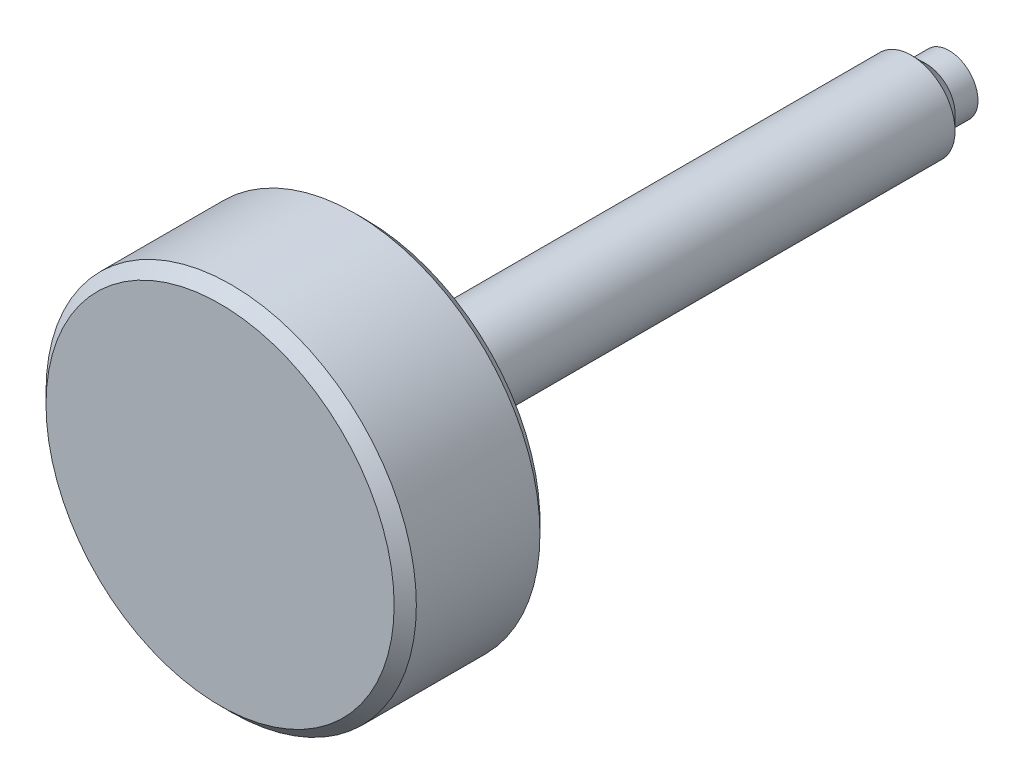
ISO-10303-21;
HEADER;
FILE_DESCRIPTION(('STEP AP214'),'2;1');
FILE_NAME('part.step','',(''),(''),'','','');
FILE_SCHEMA(('AUTOMOTIVE_DESIGN { 1 0 10303 214 1 1 1 1 }'));
ENDSEC;
DATA;
#1=APPLICATION_CONTEXT('core data for automotive mechanical design processes');
#2=APPLICATION_PROTOCOL_DEFINITION('international standard','automotive_design',2000,#1);
#3=PRODUCT_CONTEXT('',#1,'mechanical');
#4=PRODUCT('Part','Part','',(#3));
#5=PRODUCT_RELATED_PRODUCT_CATEGORY('part','',(#4));
#6=PRODUCT_DEFINITION_FORMATION('','',#4);
#7=PRODUCT_DEFINITION_CONTEXT('part definition',#1,'design');
#8=PRODUCT_DEFINITION('design','',#6,#7);
#9=PRODUCT_DEFINITION_SHAPE('','',#8);
#10=(LENGTH_UNIT() NAMED_UNIT(*) SI_UNIT(.MILLI.,.METRE.));
#11=(NAMED_UNIT(*) PLANE_ANGLE_UNIT() SI_UNIT($,.RADIAN.));
#12=(NAMED_UNIT(*) SI_UNIT($,.STERADIAN.) SOLID_ANGLE_UNIT());
#13=UNCERTAINTY_MEASURE_WITH_UNIT(LENGTH_MEASURE(1.E-05),#10,'distance_accuracy_value','');
#14=(GEOMETRIC_REPRESENTATION_CONTEXT(3) GLOBAL_UNCERTAINTY_ASSIGNED_CONTEXT((#13)) GLOBAL_UNIT_ASSIGNED_CONTEXT((#10,
#11,#12)) REPRESENTATION_CONTEXT('',''));
#15=CARTESIAN_POINT('',(0.,0.,0.));
#16=DIRECTION('',(0.,0.,1.));
#17=DIRECTION('',(1.,0.,0.));
#18=AXIS2_PLACEMENT_3D('',#15,#16,#17);
#19=CARTESIAN_POINT('',(12.081256,-12.081256,0.));
#20=DIRECTION('',(0.,0.,1.));
#21=DIRECTION('',(1.,0.,0.));
#22=AXIS2_PLACEMENT_3D('',#19,#20,#21);
#23=PLANE('',#22);
#24=CARTESIAN_POINT('',(0.,0.,0.));
#25=DIRECTION('',(0.,0.,1.));
#26=DIRECTION('',(1.,0.,0.));
#27=AXIS2_PLACEMENT_3D('',#24,#25,#26);
#28=CIRCLE('',#27,3.);
#29=CARTESIAN_POINT('',(3.,0.,0.));
#30=VERTEX_POINT('',#29);
#31=EDGE_CURVE('E43',#30,#30,#28,.T.);
#32=ORIENTED_EDGE('',*,*,#31,.T.);
#33=EDGE_LOOP('',(#32));
#34=FACE_BOUND('',#33,.T.);
#35=CARTESIAN_POINT('',(0.,0.,0.));
#36=DIRECTION('',(0.,0.,1.));
#37=DIRECTION('',(0.,1.,0.));
#38=AXIS2_PLACEMENT_3D('',#35,#36,#37);
#39=CIRCLE('',#38,11.938);
#40=CARTESIAN_POINT('',(0.,11.938,0.));
#41=VERTEX_POINT('',#40);
#42=EDGE_CURVE('E35',#41,#41,#39,.T.);
#43=ORIENTED_EDGE('',*,*,#42,.F.);
#44=EDGE_LOOP('',(#43));
#45=FACE_BOUND('',#44,.T.);
#46=ADVANCED_FACE('F12',(#34,#45),#23,.F.);
#47=CARTESIAN_POINT('',(0.,0.,0.762));
#48=DIRECTION('',(0.,0.,1.));
#49=DIRECTION('',(0.,1.,0.));
#50=AXIS2_PLACEMENT_3D('',#47,#48,#49);
#51=CONICAL_SURFACE('',#50,12.7,0.785398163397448);
#52=ORIENTED_EDGE('',*,*,#42,.T.);
#53=EDGE_LOOP('',(#52));
#54=FACE_BOUND('',#53,.T.);
#55=CARTESIAN_POINT('',(0.,0.,0.762));
#56=DIRECTION('',(0.,0.,-1.));
#57=DIRECTION('',(-1.,0.,0.));
#58=AXIS2_PLACEMENT_3D('',#55,#56,#57);
#59=CIRCLE('',#58,12.7);
#60=CARTESIAN_POINT('',(-12.7,0.,0.762));
#61=VERTEX_POINT('',#60);
#62=EDGE_CURVE('E25',#61,#61,#59,.F.);
#63=ORIENTED_EDGE('',*,*,#62,.F.);
#64=EDGE_LOOP('',(#63));
#65=FACE_BOUND('',#64,.T.);
#66=ADVANCED_FACE('F81',(#54,#65),#51,.T.);
#67=CARTESIAN_POINT('',(12.081256,12.081256,9.99998));
#68=DIRECTION('',(0.,0.,-1.));
#69=DIRECTION('',(-1.,0.,0.));
#70=AXIS2_PLACEMENT_3D('',#67,#68,#69);
#71=PLANE('',#70);
#72=CARTESIAN_POINT('',(0.,0.,9.99998));
#73=DIRECTION('',(0.,0.,-1.));
#74=DIRECTION('',(-1.,0.,0.));
#75=AXIS2_PLACEMENT_3D('',#72,#73,#74);
#76=CIRCLE('',#75,11.938);
#77=CARTESIAN_POINT('',(-11.938,0.,9.99998));
#78=VERTEX_POINT('',#77);
#79=EDGE_CURVE('E20',#78,#78,#76,.T.);
#80=ORIENTED_EDGE('',*,*,#79,.F.);
#81=EDGE_LOOP('',(#80));
#82=FACE_BOUND('',#81,.T.);
#83=ADVANCED_FACE('F76',(#82),#71,.F.);
#84=CARTESIAN_POINT('',(0.,0.,0.762));
#85=DIRECTION('',(0.,0.,-1.));
#86=DIRECTION('',(0.,-1.,0.));
#87=AXIS2_PLACEMENT_3D('',#84,#85,#86);
#88=CYLINDRICAL_SURFACE('',#87,12.7);
#89=CARTESIAN_POINT('',(0.,0.,9.23798));
#90=DIRECTION('',(0.,0.,-1.));
#91=DIRECTION('',(0.,-1.,0.));
#92=AXIS2_PLACEMENT_3D('',#89,#90,#91);
#93=CIRCLE('',#92,12.7);
#94=CARTESIAN_POINT('',(0.,-12.7,9.23797999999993));
#95=VERTEX_POINT('',#94);
#96=EDGE_CURVE('E8',#95,#95,#93,.F.);
#97=ORIENTED_EDGE('',*,*,#96,.F.);
#98=EDGE_LOOP('',(#97));
#99=FACE_BOUND('',#98,.T.);
#100=ORIENTED_EDGE('',*,*,#62,.T.);
#101=EDGE_LOOP('',(#100));
#102=FACE_BOUND('',#101,.T.);
#103=ADVANCED_FACE('F68',(#99,#102),#88,.T.);
#104=CARTESIAN_POINT('',(0.,0.,9.23798));
#105=DIRECTION('',(0.,0.,-1.));
#106=DIRECTION('',(-1.,0.,0.));
#107=AXIS2_PLACEMENT_3D('',#104,#105,#106);
#108=CONICAL_SURFACE('',#107,12.7,0.785398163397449);
#109=ORIENTED_EDGE('',*,*,#79,.T.);
#110=EDGE_LOOP('',(#109));
#111=FACE_BOUND('',#110,.T.);
#112=ORIENTED_EDGE('',*,*,#96,.T.);
#113=EDGE_LOOP('',(#112));
#114=FACE_BOUND('',#113,.T.);
#115=ADVANCED_FACE('F14',(#111,#114),#108,.T.);
#116=CARTESIAN_POINT('',(0.,0.,15.6829297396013));
#117=DIRECTION('',(0.,0.,1.));
#118=DIRECTION('',(1.,0.,0.));
#119=AXIS2_PLACEMENT_3D('',#116,#117,#118);
#120=CYLINDRICAL_SURFACE('',#119,3.);
#121=CARTESIAN_POINT('',(0.,0.,-37.40632));
#122=DIRECTION('',(0.,0.,1.));
#123=DIRECTION('',(1.,0.,0.));
#124=AXIS2_PLACEMENT_3D('',#121,#122,#123);
#125=CIRCLE('',#124,3.);
#126=CARTESIAN_POINT('',(3.,0.,-37.40632));
#127=VERTEX_POINT('',#126);
#128=EDGE_CURVE('E46',#127,#127,#125,.T.);
#129=ORIENTED_EDGE('',*,*,#128,.T.);
#130=EDGE_LOOP('',(#129));
#131=FACE_BOUND('',#130,.T.);
#132=ORIENTED_EDGE('',*,*,#31,.F.);
#133=EDGE_LOOP('',(#132));
#134=FACE_BOUND('',#133,.T.);
#135=ADVANCED_FACE('F50',(#131,#134),#120,.T.);
#136=CARTESIAN_POINT('',(2.0049744,-2.0049744,-39.99992));
#137=DIRECTION('',(0.,0.,1.));
#138=DIRECTION('',(1.,0.,0.));
#139=AXIS2_PLACEMENT_3D('',#136,#137,#138);
#140=PLANE('',#139);
#141=CARTESIAN_POINT('',(0.,0.,-39.99992));
#142=DIRECTION('',(0.,0.,-1.));
#143=DIRECTION('',(0.,-1.,0.));
#144=AXIS2_PLACEMENT_3D('',#141,#142,#143);
#145=CIRCLE('',#144,1.9812);
#146=CARTESIAN_POINT('',(0.,-1.9812,-39.99992));
#147=VERTEX_POINT('',#146);
#148=EDGE_CURVE('E16',#147,#147,#145,.F.);
#149=ORIENTED_EDGE('',*,*,#148,.F.);
#150=EDGE_LOOP('',(#149));
#151=FACE_BOUND('',#150,.T.);
#152=ADVANCED_FACE('F63',(#151),#140,.F.);
#153=CARTESIAN_POINT('',(0.,0.,-39.99992));
#154=DIRECTION('',(0.,0.,-1.));
#155=DIRECTION('',(0.,-1.,0.));
#156=AXIS2_PLACEMENT_3D('',#153,#154,#155);
#157=CYLINDRICAL_SURFACE('',#156,1.9812);
#158=ORIENTED_EDGE('',*,*,#148,.T.);
#159=EDGE_LOOP('',(#158));
#160=FACE_BOUND('',#159,.T.);
#161=CARTESIAN_POINT('',(0.,0.,-38.42512));
#162=DIRECTION('',(0.,0.,1.));
#163=DIRECTION('',(1.,0.,0.));
#164=AXIS2_PLACEMENT_3D('',#161,#162,#163);
#165=CIRCLE('',#164,1.9812);
#166=CARTESIAN_POINT('',(1.9812,0.,-38.42512));
#167=VERTEX_POINT('',#166);
#168=EDGE_CURVE('E33',#167,#167,#165,.T.);
#169=ORIENTED_EDGE('',*,*,#168,.F.);
#170=EDGE_LOOP('',(#169));
#171=FACE_BOUND('',#170,.T.);
#172=ADVANCED_FACE('F55',(#160,#171),#157,.T.);
#173=CARTESIAN_POINT('',(0.,0.,-37.40658));
#174=DIRECTION('',(0.,0.,1.));
#175=DIRECTION('',(1.,0.,0.));
#176=AXIS2_PLACEMENT_3D('',#173,#174,#175);
#177=CONICAL_SURFACE('',#176,2.99974,0.785398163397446);
#178=ORIENTED_EDGE('',*,*,#168,.T.);
#179=EDGE_LOOP('',(#178));
#180=FACE_BOUND('',#179,.T.);
#181=ORIENTED_EDGE('',*,*,#128,.F.);
#182=EDGE_LOOP('',(#181));
#183=FACE_BOUND('',#182,.T.);
#184=ADVANCED_FACE('F53',(#180,#183),#177,.T.);
#185=CLOSED_SHELL('',(#46,#66,#83,#103,#115,#135,#152,#172,#184));
#186=MANIFOLD_SOLID_BREP('B1',#185);
#187=ADVANCED_BREP_SHAPE_REPRESENTATION('',(#18,#186),#14);
#188=SHAPE_DEFINITION_REPRESENTATION(#9,#187);
ENDSEC;
END-ISO-10303-21;
